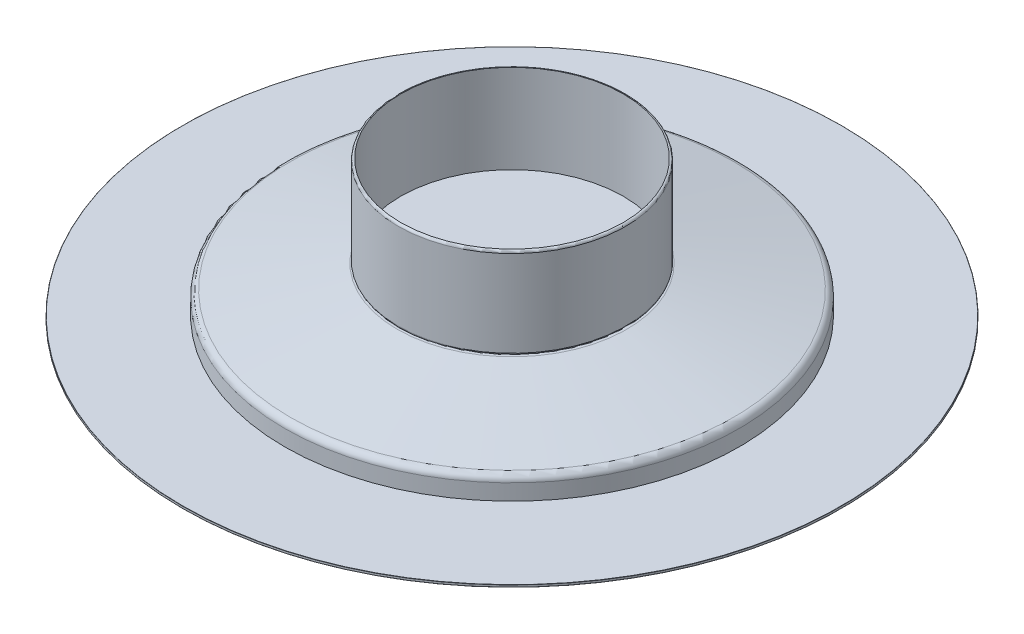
ISO-10303-21;
HEADER;
FILE_DESCRIPTION(('STEP AP214'),'2;1');
FILE_NAME('part.step','',(''),(''),'','','');
FILE_SCHEMA(('AUTOMOTIVE_DESIGN { 1 0 10303 214 1 1 1 1 }'));
ENDSEC;
DATA;
#1=APPLICATION_CONTEXT('core data for automotive mechanical design processes');
#2=APPLICATION_PROTOCOL_DEFINITION('international standard','automotive_design',2000,#1);
#3=PRODUCT_CONTEXT('',#1,'mechanical');
#4=PRODUCT('Part','Part','',(#3));
#5=PRODUCT_RELATED_PRODUCT_CATEGORY('part','',(#4));
#6=PRODUCT_DEFINITION_FORMATION('','',#4);
#7=PRODUCT_DEFINITION_CONTEXT('part definition',#1,'design');
#8=PRODUCT_DEFINITION('design','',#6,#7);
#9=PRODUCT_DEFINITION_SHAPE('','',#8);
#10=(LENGTH_UNIT() NAMED_UNIT(*) SI_UNIT(.MILLI.,.METRE.));
#11=(NAMED_UNIT(*) PLANE_ANGLE_UNIT() SI_UNIT($,.RADIAN.));
#12=(NAMED_UNIT(*) SI_UNIT($,.STERADIAN.) SOLID_ANGLE_UNIT());
#13=UNCERTAINTY_MEASURE_WITH_UNIT(LENGTH_MEASURE(1.E-05),#10,'distance_accuracy_value','');
#14=(GEOMETRIC_REPRESENTATION_CONTEXT(3) GLOBAL_UNCERTAINTY_ASSIGNED_CONTEXT((#13)) GLOBAL_UNIT_ASSIGNED_CONTEXT((#10,
#11,#12)) REPRESENTATION_CONTEXT('',''));
#15=CARTESIAN_POINT('',(0.,0.,0.));
#16=DIRECTION('',(0.,0.,1.));
#17=DIRECTION('',(1.,0.,0.));
#18=AXIS2_PLACEMENT_3D('',#15,#16,#17);
#19=CARTESIAN_POINT('',(0.,61.,0.));
#20=DIRECTION('',(0.,-1.,0.));
#21=DIRECTION('',(0.,0.,-1.));
#22=AXIS2_PLACEMENT_3D('',#19,#20,#21);
#23=CYLINDRICAL_SURFACE('',#22,50.);
#24=CARTESIAN_POINT('',(0.,22.,0.));
#25=DIRECTION('',(0.,1.,0.));
#26=DIRECTION('',(0.,0.,1.));
#27=AXIS2_PLACEMENT_3D('',#24,#25,#26);
#28=CIRCLE('',#27,50.);
#29=CARTESIAN_POINT('',(0.,22.,50.));
#30=VERTEX_POINT('',#29);
#31=EDGE_CURVE('E47',#30,#30,#28,.T.);
#32=ORIENTED_EDGE('',*,*,#31,.T.);
#33=EDGE_LOOP('',(#32));
#34=FACE_BOUND('',#33,.T.);
#35=CARTESIAN_POINT('',(0.,60.,0.));
#36=DIRECTION('',(0.,1.,0.));
#37=DIRECTION('',(0.,0.,1.));
#38=AXIS2_PLACEMENT_3D('',#35,#36,#37);
#39=CIRCLE('',#38,50.);
#40=CARTESIAN_POINT('',(0.,60.,50.));
#41=VERTEX_POINT('',#40);
#42=EDGE_CURVE('E51',#41,#41,#39,.F.);
#43=ORIENTED_EDGE('',*,*,#42,.T.);
#44=EDGE_LOOP('',(#43));
#45=FACE_BOUND('',#44,.T.);
#46=ADVANCED_FACE('F40',(#34,#45),#23,.T.);
#47=CARTESIAN_POINT('',(0.,21.,0.));
#48=DIRECTION('',(0.,1.,0.));
#49=DIRECTION('',(0.,0.,1.));
#50=AXIS2_PLACEMENT_3D('',#47,#48,#49);
#51=PLANE('',#50);
#52=CARTESIAN_POINT('',(0.,21.,0.));
#53=DIRECTION('',(0.,1.,0.));
#54=DIRECTION('',(0.,0.,1.));
#55=AXIS2_PLACEMENT_3D('',#52,#53,#54);
#56=CIRCLE('',#55,49.);
#57=CARTESIAN_POINT('',(0.,21.,49.));
#58=VERTEX_POINT('',#57);
#59=EDGE_CURVE('E11',#58,#58,#56,.F.);
#60=ORIENTED_EDGE('',*,*,#59,.T.);
#61=EDGE_LOOP('',(#60));
#62=FACE_BOUND('',#61,.T.);
#63=ADVANCED_FACE('F76',(#62),#51,.F.);
#64=CARTESIAN_POINT('',(0.,60.,0.));
#65=DIRECTION('',(0.,1.,0.));
#66=DIRECTION('',(0.,0.,1.));
#67=AXIS2_PLACEMENT_3D('',#64,#65,#66);
#68=TOROIDAL_SURFACE('',#67,49.,1.);
#69=ORIENTED_EDGE('',*,*,#42,.F.);
#70=EDGE_LOOP('',(#69));
#71=FACE_BOUND('',#70,.T.);
#72=CARTESIAN_POINT('',(0.,61.,0.));
#73=DIRECTION('',(0.,1.,0.));
#74=DIRECTION('',(0.,0.,1.));
#75=AXIS2_PLACEMENT_3D('',#72,#73,#74);
#76=CIRCLE('',#75,49.);
#77=CARTESIAN_POINT('',(0.,61.,49.));
#78=VERTEX_POINT('',#77);
#79=EDGE_CURVE('E55',#78,#78,#76,.T.);
#80=ORIENTED_EDGE('',*,*,#79,.F.);
#81=EDGE_LOOP('',(#80));
#82=FACE_BOUND('',#81,.T.);
#83=ADVANCED_FACE('F68',(#71,#82),#68,.T.);
#84=CARTESIAN_POINT('',(0.,61.,0.));
#85=DIRECTION('',(0.,-1.,0.));
#86=DIRECTION('',(0.,0.,-1.));
#87=AXIS2_PLACEMENT_3D('',#84,#85,#86);
#88=CYLINDRICAL_SURFACE('',#87,49.);
#89=ORIENTED_EDGE('',*,*,#79,.T.);
#90=EDGE_LOOP('',(#89));
#91=FACE_BOUND('',#90,.T.);
#92=CARTESIAN_POINT('',(0.,22.,0.));
#93=DIRECTION('',(0.,1.,0.));
#94=DIRECTION('',(0.,0.,1.));
#95=AXIS2_PLACEMENT_3D('',#92,#93,#94);
#96=CIRCLE('',#95,49.);
#97=CARTESIAN_POINT('',(0.,22.,49.));
#98=VERTEX_POINT('',#97);
#99=EDGE_CURVE('E60',#98,#98,#96,.T.);
#100=ORIENTED_EDGE('',*,*,#99,.F.);
#101=EDGE_LOOP('',(#100));
#102=FACE_BOUND('',#101,.T.);
#103=ADVANCED_FACE('F66',(#91,#102),#88,.F.);
#104=CARTESIAN_POINT('',(0.,22.,0.));
#105=DIRECTION('',(0.,1.,0.));
#106=DIRECTION('',(0.,0.,1.));
#107=AXIS2_PLACEMENT_3D('',#104,#105,#106);
#108=PLANE('',#107);
#109=ORIENTED_EDGE('',*,*,#99,.T.);
#110=EDGE_LOOP('',(#109));
#111=FACE_BOUND('',#110,.T.);
#112=ADVANCED_FACE('F64',(#111),#108,.T.);
#113=CARTESIAN_POINT('',(0.,22.,0.));
#114=DIRECTION('',(0.,1.,0.));
#115=DIRECTION('',(0.,0.,1.));
#116=AXIS2_PLACEMENT_3D('',#113,#114,#115);
#117=TOROIDAL_SURFACE('',#116,49.,1.);
#118=ORIENTED_EDGE('',*,*,#59,.F.);
#119=EDGE_LOOP('',(#118));
#120=FACE_BOUND('',#119,.T.);
#121=ORIENTED_EDGE('',*,*,#31,.F.);
#122=EDGE_LOOP('',(#121));
#123=FACE_BOUND('',#122,.T.);
#124=ADVANCED_FACE('F42',(#120,#123),#117,.T.);
#125=CLOSED_SHELL('',(#46,#63,#83,#103,#112,#124));
#126=MANIFOLD_SOLID_BREP('B2',#125);
#127=CARTESIAN_POINT('',(0.,11.,0.));
#128=DIRECTION('',(0.,-1.,0.));
#129=DIRECTION('',(0.,0.,1.));
#130=AXIS2_PLACEMENT_3D('',#127,#128,#129);
#131=CONICAL_SURFACE('',#130,97.5,1.36135681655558);
#132=CARTESIAN_POINT('',(0.,21.,0.));
#133=DIRECTION('',(0.,1.,0.));
#134=DIRECTION('',(0.,0.,1.));
#135=AXIS2_PLACEMENT_3D('',#132,#133,#134);
#136=CIRCLE('',#135,50.4536989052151);
#137=CARTESIAN_POINT('',(0.,21.,50.4536989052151));
#138=VERTEX_POINT('',#137);
#139=EDGE_CURVE('E39',#138,#138,#136,.T.);
#140=ORIENTED_EDGE('',*,*,#139,.F.);
#141=EDGE_LOOP('',(#140));
#142=FACE_BOUND('',#141,.T.);
#143=CARTESIAN_POINT('',(0.,11.,0.));
#144=DIRECTION('',(0.,1.,0.));
#145=DIRECTION('',(0.,0.,1.));
#146=AXIS2_PLACEMENT_3D('',#143,#144,#145);
#147=CIRCLE('',#146,97.5);
#148=CARTESIAN_POINT('',(0.,11.,97.5));
#149=VERTEX_POINT('',#148);
#150=EDGE_CURVE('E140',#149,#149,#147,.T.);
#151=ORIENTED_EDGE('',*,*,#150,.T.);
#152=EDGE_LOOP('',(#151));
#153=FACE_BOUND('',#152,.T.);
#154=ADVANCED_FACE('F134',(#142,#153),#131,.T.);
#155=CARTESIAN_POINT('',(0.,21.,0.));
#156=DIRECTION('',(0.,1.,0.));
#157=DIRECTION('',(0.,0.,1.));
#158=AXIS2_PLACEMENT_3D('',#155,#156,#157);
#159=PLANE('',#158);
#160=ORIENTED_EDGE('',*,*,#139,.T.);
#161=EDGE_LOOP('',(#160));
#162=FACE_BOUND('',#161,.T.);
#163=ADVANCED_FACE('F149',(#162),#159,.T.);
#164=CARTESIAN_POINT('',(0.,11.,0.));
#165=DIRECTION('',(0.,1.,0.));
#166=DIRECTION('',(0.,0.,1.));
#167=AXIS2_PLACEMENT_3D('',#164,#165,#166);
#168=PLANE('',#167);
#169=ORIENTED_EDGE('',*,*,#150,.F.);
#170=EDGE_LOOP('',(#169));
#171=FACE_BOUND('',#170,.T.);
#172=ADVANCED_FACE('F147',(#171),#168,.F.);
#173=CLOSED_SHELL('',(#154,#163,#172));
#174=MANIFOLD_SOLID_BREP('B6',#173);
#175=CARTESIAN_POINT('',(0.,11.,0.));
#176=DIRECTION('',(0.,-1.,0.));
#177=DIRECTION('',(0.,0.,-1.));
#178=AXIS2_PLACEMENT_3D('',#175,#176,#177);
#179=CYLINDRICAL_SURFACE('',#178,100.);
#180=CARTESIAN_POINT('',(0.,8.,0.));
#181=DIRECTION('',(0.,1.,0.));
#182=DIRECTION('',(0.,0.,1.));
#183=AXIS2_PLACEMENT_3D('',#180,#181,#182);
#184=CIRCLE('',#183,100.);
#185=CARTESIAN_POINT('',(0.,8.,100.));
#186=VERTEX_POINT('',#185);
#187=EDGE_CURVE('E133',#186,#186,#184,.F.);
#188=ORIENTED_EDGE('',*,*,#187,.T.);
#189=EDGE_LOOP('',(#188));
#190=FACE_BOUND('',#189,.T.);
#191=CARTESIAN_POINT('',(0.,1.,0.));
#192=DIRECTION('',(0.,1.,0.));
#193=DIRECTION('',(0.,0.,1.));
#194=AXIS2_PLACEMENT_3D('',#191,#192,#193);
#195=CIRCLE('',#194,100.);
#196=CARTESIAN_POINT('',(0.,1.,100.));
#197=VERTEX_POINT('',#196);
#198=EDGE_CURVE('E193',#197,#197,#195,.T.);
#199=ORIENTED_EDGE('',*,*,#198,.T.);
#200=EDGE_LOOP('',(#199));
#201=FACE_BOUND('',#200,.T.);
#202=ADVANCED_FACE('F182',(#190,#201),#179,.T.);
#203=CARTESIAN_POINT('',(0.,11.,0.));
#204=DIRECTION('',(0.,1.,0.));
#205=DIRECTION('',(0.,0.,1.));
#206=AXIS2_PLACEMENT_3D('',#203,#204,#205);
#207=PLANE('',#206);
#208=CARTESIAN_POINT('',(0.,11.,0.));
#209=DIRECTION('',(0.,1.,0.));
#210=DIRECTION('',(0.,0.,1.));
#211=AXIS2_PLACEMENT_3D('',#208,#209,#210);
#212=CIRCLE('',#211,97.);
#213=CARTESIAN_POINT('',(0.,11.,97.));
#214=VERTEX_POINT('',#213);
#215=EDGE_CURVE('E189',#214,#214,#212,.T.);
#216=ORIENTED_EDGE('',*,*,#215,.T.);
#217=EDGE_LOOP('',(#216));
#218=FACE_BOUND('',#217,.T.);
#219=ADVANCED_FACE('F203',(#218),#207,.T.);
#220=CARTESIAN_POINT('',(0.,1.,0.));
#221=DIRECTION('',(0.,1.,0.));
#222=DIRECTION('',(0.,0.,1.));
#223=AXIS2_PLACEMENT_3D('',#220,#221,#222);
#224=PLANE('',#223);
#225=ORIENTED_EDGE('',*,*,#198,.F.);
#226=EDGE_LOOP('',(#225));
#227=FACE_BOUND('',#226,.T.);
#228=ADVANCED_FACE('F201',(#227),#224,.F.);
#229=CARTESIAN_POINT('',(0.,8.,0.));
#230=DIRECTION('',(0.,1.,0.));
#231=DIRECTION('',(0.,0.,1.));
#232=AXIS2_PLACEMENT_3D('',#229,#230,#231);
#233=TOROIDAL_SURFACE('',#232,97.,3.);
#234=ORIENTED_EDGE('',*,*,#187,.F.);
#235=EDGE_LOOP('',(#234));
#236=FACE_BOUND('',#235,.T.);
#237=ORIENTED_EDGE('',*,*,#215,.F.);
#238=EDGE_LOOP('',(#237));
#239=FACE_BOUND('',#238,.T.);
#240=ADVANCED_FACE('F184',(#236,#239),#233,.T.);
#241=CLOSED_SHELL('',(#202,#219,#228,#240));
#242=MANIFOLD_SOLID_BREP('B34',#241);
#243=CARTESIAN_POINT('',(0.,1.,0.));
#244=DIRECTION('',(0.,-1.,0.));
#245=DIRECTION('',(0.,0.,-1.));
#246=AXIS2_PLACEMENT_3D('',#243,#244,#245);
#247=CYLINDRICAL_SURFACE('',#246,145.);
#248=CARTESIAN_POINT('',(0.,0.1,0.));
#249=DIRECTION('',(0.,1.,0.));
#250=DIRECTION('',(0.,0.,1.));
#251=AXIS2_PLACEMENT_3D('',#248,#249,#250);
#252=CIRCLE('',#251,145.);
#253=CARTESIAN_POINT('',(0.,0.1,145.));
#254=VERTEX_POINT('',#253);
#255=EDGE_CURVE('E249',#254,#254,#252,.T.);
#256=ORIENTED_EDGE('',*,*,#255,.T.);
#257=EDGE_LOOP('',(#256));
#258=FACE_BOUND('',#257,.T.);
#259=CARTESIAN_POINT('',(0.,0.9,0.));
#260=DIRECTION('',(0.,1.,0.));
#261=DIRECTION('',(0.,0.,1.));
#262=AXIS2_PLACEMENT_3D('',#259,#260,#261);
#263=CIRCLE('',#262,145.);
#264=CARTESIAN_POINT('',(0.,0.9,145.));
#265=VERTEX_POINT('',#264);
#266=EDGE_CURVE('E253',#265,#265,#263,.F.);
#267=ORIENTED_EDGE('',*,*,#266,.T.);
#268=EDGE_LOOP('',(#267));
#269=FACE_BOUND('',#268,.T.);
#270=ADVANCED_FACE('F238',(#258,#269),#247,.T.);
#271=CARTESIAN_POINT('',(0.,1.,0.));
#272=DIRECTION('',(0.,1.,0.));
#273=DIRECTION('',(0.,0.,1.));
#274=AXIS2_PLACEMENT_3D('',#271,#272,#273);
#275=PLANE('',#274);
#276=CARTESIAN_POINT('',(0.,1.,0.));
#277=DIRECTION('',(0.,1.,0.));
#278=DIRECTION('',(0.,0.,1.));
#279=AXIS2_PLACEMENT_3D('',#276,#277,#278);
#280=CIRCLE('',#279,144.9);
#281=CARTESIAN_POINT('',(0.,1.,144.9));
#282=VERTEX_POINT('',#281);
#283=EDGE_CURVE('E181',#282,#282,#280,.T.);
#284=ORIENTED_EDGE('',*,*,#283,.T.);
#285=EDGE_LOOP('',(#284));
#286=FACE_BOUND('',#285,.T.);
#287=ADVANCED_FACE('F269',(#286),#275,.T.);
#288=CARTESIAN_POINT('',(0.,0.,0.));
#289=DIRECTION('',(0.,1.,0.));
#290=DIRECTION('',(0.,0.,1.));
#291=AXIS2_PLACEMENT_3D('',#288,#289,#290);
#292=PLANE('',#291);
#293=CARTESIAN_POINT('',(0.,0.,0.));
#294=DIRECTION('',(0.,1.,0.));
#295=DIRECTION('',(0.,0.,1.));
#296=AXIS2_PLACEMENT_3D('',#293,#294,#295);
#297=CIRCLE('',#296,144.9);
#298=CARTESIAN_POINT('',(0.,0.,144.9));
#299=VERTEX_POINT('',#298);
#300=EDGE_CURVE('E245',#299,#299,#297,.F.);
#301=ORIENTED_EDGE('',*,*,#300,.T.);
#302=EDGE_LOOP('',(#301));
#303=FACE_BOUND('',#302,.T.);
#304=ADVANCED_FACE('F266',(#303),#292,.F.);
#305=CARTESIAN_POINT('',(0.,0.1,0.));
#306=DIRECTION('',(0.,1.,0.));
#307=DIRECTION('',(0.,0.,1.));
#308=AXIS2_PLACEMENT_3D('',#305,#306,#307);
#309=TOROIDAL_SURFACE('',#308,144.9,0.1);
#310=ORIENTED_EDGE('',*,*,#300,.F.);
#311=EDGE_LOOP('',(#310));
#312=FACE_BOUND('',#311,.T.);
#313=ORIENTED_EDGE('',*,*,#255,.F.);
#314=EDGE_LOOP('',(#313));
#315=FACE_BOUND('',#314,.T.);
#316=ADVANCED_FACE('F262',(#312,#315),#309,.T.);
#317=CARTESIAN_POINT('',(0.,0.9,0.));
#318=DIRECTION('',(0.,1.,0.));
#319=DIRECTION('',(0.,0.,1.));
#320=AXIS2_PLACEMENT_3D('',#317,#318,#319);
#321=TOROIDAL_SURFACE('',#320,144.9,0.1);
#322=ORIENTED_EDGE('',*,*,#266,.F.);
#323=EDGE_LOOP('',(#322));
#324=FACE_BOUND('',#323,.T.);
#325=ORIENTED_EDGE('',*,*,#283,.F.);
#326=EDGE_LOOP('',(#325));
#327=FACE_BOUND('',#326,.T.);
#328=ADVANCED_FACE('F240',(#324,#327),#321,.T.);
#329=CLOSED_SHELL('',(#270,#287,#304,#316,#328));
#330=MANIFOLD_SOLID_BREP('B128',#329);
#331=ADVANCED_BREP_SHAPE_REPRESENTATION('',(#18,#126,#174,#242,#330),#14);
#332=SHAPE_DEFINITION_REPRESENTATION(#9,#331);
ENDSEC;
END-ISO-10303-21;
